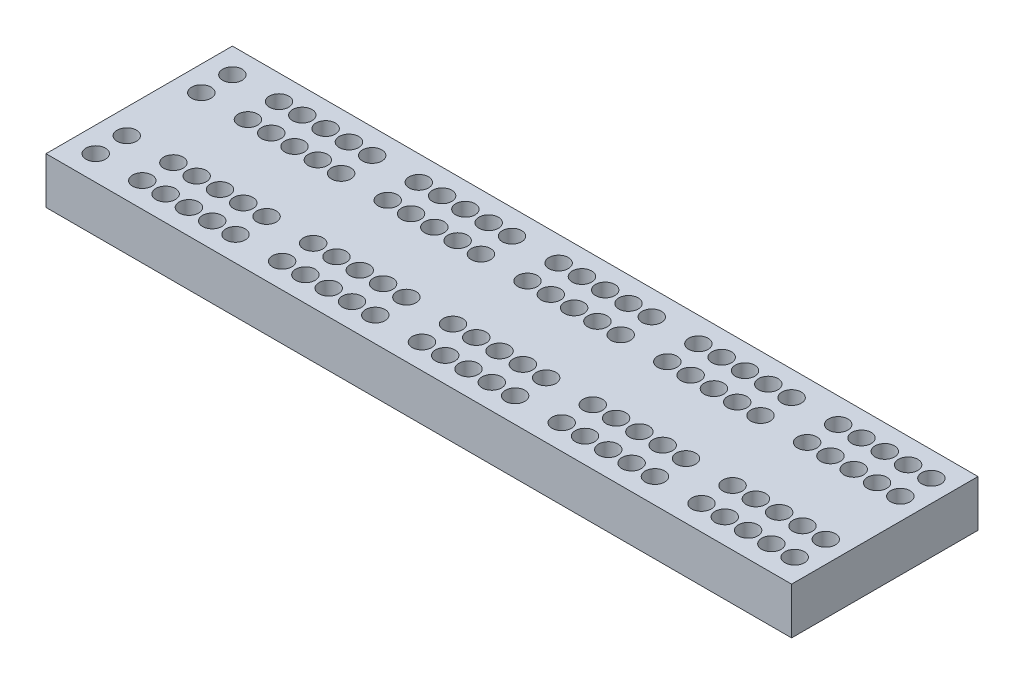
from build123d import *

# Parameters (mm, degrees)
SKETCH1_W            = 304.8
SKETCH1_H            = 19.05
EXTRUDE1_DEPTH       = 38.1
LPATTERN1_COUNT      = 31
LPATTERN1_PITCH      = 9.525
LPATTERN1_COUNT_DIR2 = 2
LPATTERN1_PITCH_DIR2 = 12.7


with BuildPart() as part:
    # Sketch1 → Extrude1 (new, symmetric)
    with BuildSketch(Plane.XY):
        with Locations((152.4, 9.525)):
            Rectangle(SKETCH1_W, SKETCH1_H)
    extrude(amount=EXTRUDE1_DEPTH, both=True)

    # Sketch2 → 5_16 _0.3125_ Diameter Hole1 (revolve, cut)
    with BuildSketch(Plane(origin=(10.16, 19.05, -27.94), x_dir=(0, 0, 1), z_dir=(1, 0, 0))):
        Polygon((0, 0), (0, 15.084665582), (3.96875, 12.7), (3.96875, 0), align=None)
    f_5_16_0_3125_diameter_hole1 = revolve(axis=Axis((10.16, 25.4, -27.94), (0, -1, 0)), mode=Mode.SUBTRACT)

    # LPattern1: 5_16 _0.3125_ Diameter Hole1 31 × 2, 10 skipped
    with Locations(*[(i * LPATTERN1_PITCH, 0, j * LPATTERN1_PITCH_DIR2) for i in range(LPATTERN1_COUNT) for j in range(LPATTERN1_COUNT_DIR2) if (i, j) not in ((0, 0), (1, 0), (1, 1), (7, 0), (7, 1), (13, 0), (13, 1), (19, 0), (19, 1), (25, 0), (25, 1))]):
        add(f_5_16_0_3125_diameter_hole1, mode=Mode.SUBTRACT)

    # Mirror1: 5_16 _0.3125_ Diameter Hole1 across plane
    add(f_5_16_0_3125_diameter_hole1.mirror(Plane.XY), mode=Mode.SUBTRACT)

    # Mirror1 copy 1 sketch → Mirror1 copy 1 (revolve, cut)
    with BuildSketch(Plane(origin=(10.16, 19.05, 15.24), x_dir=(0, 0, -1), z_dir=(1, 0, 0))):
        Polygon((0, 0), (0, -15.084665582), (3.96875, -12.7), (3.96875, 0), align=None)
    revolve(axis=Axis((10.16, 25.4, 15.24), (0, 1, 0)), mode=Mode.SUBTRACT)

    # Mirror1 copy 2 sketch → Mirror1 copy 2 (revolve, cut)
    with BuildSketch(Plane(origin=(29.21, 19.05, 27.94), x_dir=(0, 0, -1), z_dir=(1, 0, 0))):
        Polygon((0, 0), (0, -15.084665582), (3.96875, -12.7), (3.96875, 0), align=None)
    revolve(axis=Axis((29.21, 25.4, 27.94), (0, 1, 0)), mode=Mode.SUBTRACT)

    # Mirror1 copy 3 sketch → Mirror1 copy 3 (revolve, cut)
    with BuildSketch(Plane(origin=(29.21, 19.05, 15.24), x_dir=(0, 0, -1), z_dir=(1, 0, 0))):
        Polygon((0, 0), (0, -15.084665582), (3.96875, -12.7), (3.96875, 0), align=None)
    revolve(axis=Axis((29.21, 25.4, 15.24), (0, 1, 0)), mode=Mode.SUBTRACT)

    # Mirror1 copy 4 sketch → Mirror1 copy 4 (revolve, cut)
    with BuildSketch(Plane(origin=(38.735, 19.05, 27.94), x_dir=(0, 0, -1), z_dir=(1, 0, 0))):
        Polygon((0, 0), (0, -15.084665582), (3.96875, -12.7), (3.96875, 0), align=None)
    revolve(axis=Axis((38.735, 25.4, 27.94), (0, 1, 0)), mode=Mode.SUBTRACT)

    # Mirror1 copy 5 sketch → Mirror1 copy 5 (revolve, cut)
    with BuildSketch(Plane(origin=(38.735, 19.05, 15.24), x_dir=(0, 0, -1), z_dir=(1, 0, 0))):
        Polygon((0, 0), (0, -15.084665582), (3.96875, -12.7), (3.96875, 0), align=None)
    revolve(axis=Axis((38.735, 25.4, 15.24), (0, 1, 0)), mode=Mode.SUBTRACT)

    # Mirror1 copy 6 sketch → Mirror1 copy 6 (revolve, cut)
    with BuildSketch(Plane(origin=(48.26, 19.05, 27.94), x_dir=(0, 0, -1), z_dir=(1, 0, 0))):
        Polygon((0, 0), (0, -15.084665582), (3.96875, -12.7), (3.96875, 0), align=None)
    revolve(axis=Axis((48.26, 25.4, 27.94), (0, 1, 0)), mode=Mode.SUBTRACT)

    # Mirror1 copy 7 sketch → Mirror1 copy 7 (revolve, cut)
    with BuildSketch(Plane(origin=(48.26, 19.05, 15.24), x_dir=(0, 0, -1), z_dir=(1, 0, 0))):
        Polygon((0, 0), (0, -15.084665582), (3.96875, -12.7), (3.96875, 0), align=None)
    revolve(axis=Axis((48.26, 25.4, 15.24), (0, 1, 0)), mode=Mode.SUBTRACT)

    # Mirror1 copy 8 sketch → Mirror1 copy 8 (revolve, cut)
    with BuildSketch(Plane(origin=(57.785, 19.05, 27.94), x_dir=(0, 0, -1), z_dir=(1, 0, 0))):
        Polygon((0, 0), (0, -15.084665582), (3.96875, -12.7), (3.96875, 0), align=None)
    revolve(axis=Axis((57.785, 25.4, 27.94), (0, 1, 0)), mode=Mode.SUBTRACT)

    # Mirror1 copy 9 sketch → Mirror1 copy 9 (revolve, cut)
    with BuildSketch(Plane(origin=(57.785, 19.05, 15.24), x_dir=(0, 0, -1), z_dir=(1, 0, 0))):
        Polygon((0, 0), (0, -15.084665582), (3.96875, -12.7), (3.96875, 0), align=None)
    revolve(axis=Axis((57.785, 25.4, 15.24), (0, 1, 0)), mode=Mode.SUBTRACT)

    # Mirror1 copy 10 sketch → Mirror1 copy 10 (revolve, cut)
    with BuildSketch(Plane(origin=(67.31, 19.05, 27.94), x_dir=(0, 0, -1), z_dir=(1, 0, 0))):
        Polygon((0, 0), (0, -15.084665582), (3.96875, -12.7), (3.96875, 0), align=None)
    revolve(axis=Axis((67.31, 25.4, 27.94), (0, 1, 0)), mode=Mode.SUBTRACT)

    # Mirror1 copy 11 sketch → Mirror1 copy 11 (revolve, cut)
    with BuildSketch(Plane(origin=(67.31, 19.05, 15.24), x_dir=(0, 0, -1), z_dir=(1, 0, 0))):
        Polygon((0, 0), (0, -15.084665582), (3.96875, -12.7), (3.96875, 0), align=None)
    revolve(axis=Axis((67.31, 25.4, 15.24), (0, 1, 0)), mode=Mode.SUBTRACT)

    # Mirror1 copy 12 sketch → Mirror1 copy 12 (revolve, cut)
    with BuildSketch(Plane(origin=(86.36, 19.05, 27.94), x_dir=(0, 0, -1), z_dir=(1, 0, 0))):
        Polygon((0, 0), (0, -15.084665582), (3.96875, -12.7), (3.96875, 0), align=None)
    revolve(axis=Axis((86.36, 25.4, 27.94), (0, 1, 0)), mode=Mode.SUBTRACT)

    # Mirror1 copy 13 sketch → Mirror1 copy 13 (revolve, cut)
    with BuildSketch(Plane(origin=(86.36, 19.05, 15.24), x_dir=(0, 0, -1), z_dir=(1, 0, 0))):
        Polygon((0, 0), (0, -15.084665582), (3.96875, -12.7), (3.96875, 0), align=None)
    revolve(axis=Axis((86.36, 25.4, 15.24), (0, 1, 0)), mode=Mode.SUBTRACT)

    # Mirror1 copy 14 sketch → Mirror1 copy 14 (revolve, cut)
    with BuildSketch(Plane(origin=(95.885, 19.05, 27.94), x_dir=(0, 0, -1), z_dir=(1, 0, 0))):
        Polygon((0, 0), (0, -15.084665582), (3.96875, -12.7), (3.96875, 0), align=None)
    revolve(axis=Axis((95.885, 25.4, 27.94), (0, 1, 0)), mode=Mode.SUBTRACT)

    # Mirror1 copy 15 sketch → Mirror1 copy 15 (revolve, cut)
    with BuildSketch(Plane(origin=(95.885, 19.05, 15.24), x_dir=(0, 0, -1), z_dir=(1, 0, 0))):
        Polygon((0, 0), (0, -15.084665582), (3.96875, -12.7), (3.96875, 0), align=None)
    revolve(axis=Axis((95.885, 25.4, 15.24), (0, 1, 0)), mode=Mode.SUBTRACT)

    # Mirror1 copy 16 sketch → Mirror1 copy 16 (revolve, cut)
    with BuildSketch(Plane(origin=(105.41, 19.05, 27.94), x_dir=(0, 0, -1), z_dir=(1, 0, 0))):
        Polygon((0, 0), (0, -15.084665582), (3.96875, -12.7), (3.96875, 0), align=None)
    revolve(axis=Axis((105.41, 25.4, 27.94), (0, 1, 0)), mode=Mode.SUBTRACT)

    # Mirror1 copy 17 sketch → Mirror1 copy 17 (revolve, cut)
    with BuildSketch(Plane(origin=(105.41, 19.05, 15.24), x_dir=(0, 0, -1), z_dir=(1, 0, 0))):
        Polygon((0, 0), (0, -15.084665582), (3.96875, -12.7), (3.96875, 0), align=None)
    revolve(axis=Axis((105.41, 25.4, 15.24), (0, 1, 0)), mode=Mode.SUBTRACT)

    # Mirror1 copy 18 sketch → Mirror1 copy 18 (revolve, cut)
    with BuildSketch(Plane(origin=(114.935, 19.05, 27.94), x_dir=(0, 0, -1), z_dir=(1, 0, 0))):
        Polygon((0, 0), (0, -15.084665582), (3.96875, -12.7), (3.96875, 0), align=None)
    revolve(axis=Axis((114.935, 25.4, 27.94), (0, 1, 0)), mode=Mode.SUBTRACT)

    # Mirror1 copy 19 sketch → Mirror1 copy 19 (revolve, cut)
    with BuildSketch(Plane(origin=(114.935, 19.05, 15.24), x_dir=(0, 0, -1), z_dir=(1, 0, 0))):
        Polygon((0, 0), (0, -15.084665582), (3.96875, -12.7), (3.96875, 0), align=None)
    revolve(axis=Axis((114.935, 25.4, 15.24), (0, 1, 0)), mode=Mode.SUBTRACT)

    # Mirror1 copy 20 sketch → Mirror1 copy 20 (revolve, cut)
    with BuildSketch(Plane(origin=(124.46, 19.05, 27.94), x_dir=(0, 0, -1), z_dir=(1, 0, 0))):
        Polygon((0, 0), (0, -15.084665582), (3.96875, -12.7), (3.96875, 0), align=None)
    revolve(axis=Axis((124.46, 25.4, 27.94), (0, 1, 0)), mode=Mode.SUBTRACT)

    # Mirror1 copy 21 sketch → Mirror1 copy 21 (revolve, cut)
    with BuildSketch(Plane(origin=(124.46, 19.05, 15.24), x_dir=(0, 0, -1), z_dir=(1, 0, 0))):
        Polygon((0, 0), (0, -15.084665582), (3.96875, -12.7), (3.96875, 0), align=None)
    revolve(axis=Axis((124.46, 25.4, 15.24), (0, 1, 0)), mode=Mode.SUBTRACT)

    # Mirror1 copy 22 sketch → Mirror1 copy 22 (revolve, cut)
    with BuildSketch(Plane(origin=(143.51, 19.05, 27.94), x_dir=(0, 0, -1), z_dir=(1, 0, 0))):
        Polygon((0, 0), (0, -15.084665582), (3.96875, -12.7), (3.96875, 0), align=None)
    revolve(axis=Axis((143.51, 25.4, 27.94), (0, 1, 0)), mode=Mode.SUBTRACT)

    # Mirror1 copy 23 sketch → Mirror1 copy 23 (revolve, cut)
    with BuildSketch(Plane(origin=(143.51, 19.05, 15.24), x_dir=(0, 0, -1), z_dir=(1, 0, 0))):
        Polygon((0, 0), (0, -15.084665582), (3.96875, -12.7), (3.96875, 0), align=None)
    revolve(axis=Axis((143.51, 25.4, 15.24), (0, 1, 0)), mode=Mode.SUBTRACT)

    # Mirror1 copy 24 sketch → Mirror1 copy 24 (revolve, cut)
    with BuildSketch(Plane(origin=(153.035, 19.05, 27.94), x_dir=(0, 0, -1), z_dir=(1, 0, 0))):
        Polygon((0, 0), (0, -15.084665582), (3.96875, -12.7), (3.96875, 0), align=None)
    revolve(axis=Axis((153.035, 25.4, 27.94), (0, 1, 0)), mode=Mode.SUBTRACT)

    # Mirror1 copy 25 sketch → Mirror1 copy 25 (revolve, cut)
    with BuildSketch(Plane(origin=(153.035, 19.05, 15.24), x_dir=(0, 0, -1), z_dir=(1, 0, 0))):
        Polygon((0, 0), (0, -15.084665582), (3.96875, -12.7), (3.96875, 0), align=None)
    revolve(axis=Axis((153.035, 25.4, 15.24), (0, 1, 0)), mode=Mode.SUBTRACT)

    # Mirror1 copy 26 sketch → Mirror1 copy 26 (revolve, cut)
    with BuildSketch(Plane(origin=(162.56, 19.05, 27.94), x_dir=(0, 0, -1), z_dir=(1, 0, 0))):
        Polygon((0, 0), (0, -15.084665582), (3.96875, -12.7), (3.96875, 0), align=None)
    revolve(axis=Axis((162.56, 25.4, 27.94), (0, 1, 0)), mode=Mode.SUBTRACT)

    # Mirror1 copy 27 sketch → Mirror1 copy 27 (revolve, cut)
    with BuildSketch(Plane(origin=(162.56, 19.05, 15.24), x_dir=(0, 0, -1), z_dir=(1, 0, 0))):
        Polygon((0, 0), (0, -15.084665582), (3.96875, -12.7), (3.96875, 0), align=None)
    revolve(axis=Axis((162.56, 25.4, 15.24), (0, 1, 0)), mode=Mode.SUBTRACT)

    # Mirror1 copy 28 sketch → Mirror1 copy 28 (revolve, cut)
    with BuildSketch(Plane(origin=(172.085, 19.05, 27.94), x_dir=(0, 0, -1), z_dir=(1, 0, 0))):
        Polygon((0, 0), (0, -15.084665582), (3.96875, -12.7), (3.96875, 0), align=None)
    revolve(axis=Axis((172.085, 25.4, 27.94), (0, 1, 0)), mode=Mode.SUBTRACT)

    # Mirror1 copy 29 sketch → Mirror1 copy 29 (revolve, cut)
    with BuildSketch(Plane(origin=(172.085, 19.05, 15.24), x_dir=(0, 0, -1), z_dir=(1, 0, 0))):
        Polygon((0, 0), (0, -15.084665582), (3.96875, -12.7), (3.96875, 0), align=None)
    revolve(axis=Axis((172.085, 25.4, 15.24), (0, 1, 0)), mode=Mode.SUBTRACT)

    # Mirror1 copy 30 sketch → Mirror1 copy 30 (revolve, cut)
    with BuildSketch(Plane(origin=(181.61, 19.05, 27.94), x_dir=(0, 0, -1), z_dir=(1, 0, 0))):
        Polygon((0, 0), (0, -15.084665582), (3.96875, -12.7), (3.96875, 0), align=None)
    revolve(axis=Axis((181.61, 25.4, 27.94), (0, 1, 0)), mode=Mode.SUBTRACT)

    # Mirror1 copy 31 sketch → Mirror1 copy 31 (revolve, cut)
    with BuildSketch(Plane(origin=(181.61, 19.05, 15.24), x_dir=(0, 0, -1), z_dir=(1, 0, 0))):
        Polygon((0, 0), (0, -15.084665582), (3.96875, -12.7), (3.96875, 0), align=None)
    revolve(axis=Axis((181.61, 25.4, 15.24), (0, 1, 0)), mode=Mode.SUBTRACT)

    # Mirror1 copy 32 sketch → Mirror1 copy 32 (revolve, cut)
    with BuildSketch(Plane(origin=(200.66, 19.05, 27.94), x_dir=(0, 0, -1), z_dir=(1, 0, 0))):
        Polygon((0, 0), (0, -15.084665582), (3.96875, -12.7), (3.96875, 0), align=None)
    revolve(axis=Axis((200.66, 25.4, 27.94), (0, 1, 0)), mode=Mode.SUBTRACT)

    # Mirror1 copy 33 sketch → Mirror1 copy 33 (revolve, cut)
    with BuildSketch(Plane(origin=(200.66, 19.05, 15.24), x_dir=(0, 0, -1), z_dir=(1, 0, 0))):
        Polygon((0, 0), (0, -15.084665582), (3.96875, -12.7), (3.96875, 0), align=None)
    revolve(axis=Axis((200.66, 25.4, 15.24), (0, 1, 0)), mode=Mode.SUBTRACT)

    # Mirror1 copy 34 sketch → Mirror1 copy 34 (revolve, cut)
    with BuildSketch(Plane(origin=(210.185, 19.05, 27.94), x_dir=(0, 0, -1), z_dir=(1, 0, 0))):
        Polygon((0, 0), (0, -15.084665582), (3.96875, -12.7), (3.96875, 0), align=None)
    revolve(axis=Axis((210.185, 25.4, 27.94), (0, 1, 0)), mode=Mode.SUBTRACT)

    # Mirror1 copy 35 sketch → Mirror1 copy 35 (revolve, cut)
    with BuildSketch(Plane(origin=(210.185, 19.05, 15.24), x_dir=(0, 0, -1), z_dir=(1, 0, 0))):
        Polygon((0, 0), (0, -15.084665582), (3.96875, -12.7), (3.96875, 0), align=None)
    revolve(axis=Axis((210.185, 25.4, 15.24), (0, 1, 0)), mode=Mode.SUBTRACT)

    # Mirror1 copy 36 sketch → Mirror1 copy 36 (revolve, cut)
    with BuildSketch(Plane(origin=(219.71, 19.05, 27.94), x_dir=(0, 0, -1), z_dir=(1, 0, 0))):
        Polygon((0, 0), (0, -15.084665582), (3.96875, -12.7), (3.96875, 0), align=None)
    revolve(axis=Axis((219.71, 25.4, 27.94), (0, 1, 0)), mode=Mode.SUBTRACT)

    # Mirror1 copy 37 sketch → Mirror1 copy 37 (revolve, cut)
    with BuildSketch(Plane(origin=(219.71, 19.05, 15.24), x_dir=(0, 0, -1), z_dir=(1, 0, 0))):
        Polygon((0, 0), (0, -15.084665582), (3.96875, -12.7), (3.96875, 0), align=None)
    revolve(axis=Axis((219.71, 25.4, 15.24), (0, 1, 0)), mode=Mode.SUBTRACT)

    # Mirror1 copy 38 sketch → Mirror1 copy 38 (revolve, cut)
    with BuildSketch(Plane(origin=(229.235, 19.05, 27.94), x_dir=(0, 0, -1), z_dir=(1, 0, 0))):
        Polygon((0, 0), (0, -15.084665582), (3.96875, -12.7), (3.96875, 0), align=None)
    revolve(axis=Axis((229.235, 25.4, 27.94), (0, 1, 0)), mode=Mode.SUBTRACT)

    # Mirror1 copy 39 sketch → Mirror1 copy 39 (revolve, cut)
    with BuildSketch(Plane(origin=(229.235, 19.05, 15.24), x_dir=(0, 0, -1), z_dir=(1, 0, 0))):
        Polygon((0, 0), (0, -15.084665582), (3.96875, -12.7), (3.96875, 0), align=None)
    revolve(axis=Axis((229.235, 25.4, 15.24), (0, 1, 0)), mode=Mode.SUBTRACT)

    # Mirror1 copy 40 sketch → Mirror1 copy 40 (revolve, cut)
    with BuildSketch(Plane(origin=(238.76, 19.05, 27.94), x_dir=(0, 0, -1), z_dir=(1, 0, 0))):
        Polygon((0, 0), (0, -15.084665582), (3.96875, -12.7), (3.96875, 0), align=None)
    revolve(axis=Axis((238.76, 25.4, 27.94), (0, 1, 0)), mode=Mode.SUBTRACT)

    # Mirror1 copy 41 sketch → Mirror1 copy 41 (revolve, cut)
    with BuildSketch(Plane(origin=(238.76, 19.05, 15.24), x_dir=(0, 0, -1), z_dir=(1, 0, 0))):
        Polygon((0, 0), (0, -15.084665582), (3.96875, -12.7), (3.96875, 0), align=None)
    revolve(axis=Axis((238.76, 25.4, 15.24), (0, 1, 0)), mode=Mode.SUBTRACT)

    # Mirror1 copy 42 sketch → Mirror1 copy 42 (revolve, cut)
    with BuildSketch(Plane(origin=(257.81, 19.05, 27.94), x_dir=(0, 0, -1), z_dir=(1, 0, 0))):
        Polygon((0, 0), (0, -15.084665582), (3.96875, -12.7), (3.96875, 0), align=None)
    revolve(axis=Axis((257.81, 25.4, 27.94), (0, 1, 0)), mode=Mode.SUBTRACT)

    # Mirror1 copy 43 sketch → Mirror1 copy 43 (revolve, cut)
    with BuildSketch(Plane(origin=(257.81, 19.05, 15.24), x_dir=(0, 0, -1), z_dir=(1, 0, 0))):
        Polygon((0, 0), (0, -15.084665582), (3.96875, -12.7), (3.96875, 0), align=None)
    revolve(axis=Axis((257.81, 25.4, 15.24), (0, 1, 0)), mode=Mode.SUBTRACT)

    # Mirror1 copy 44 sketch → Mirror1 copy 44 (revolve, cut)
    with BuildSketch(Plane(origin=(267.335, 19.05, 27.94), x_dir=(0, 0, -1), z_dir=(1, 0, 0))):
        Polygon((0, 0), (0, -15.084665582), (3.96875, -12.7), (3.96875, 0), align=None)
    revolve(axis=Axis((267.335, 25.4, 27.94), (0, 1, 0)), mode=Mode.SUBTRACT)

    # Mirror1 copy 45 sketch → Mirror1 copy 45 (revolve, cut)
    with BuildSketch(Plane(origin=(267.335, 19.05, 15.24), x_dir=(0, 0, -1), z_dir=(1, 0, 0))):
        Polygon((0, 0), (0, -15.084665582), (3.96875, -12.7), (3.96875, 0), align=None)
    revolve(axis=Axis((267.335, 25.4, 15.24), (0, 1, 0)), mode=Mode.SUBTRACT)

    # Mirror1 copy 46 sketch → Mirror1 copy 46 (revolve, cut)
    with BuildSketch(Plane(origin=(276.86, 19.05, 27.94), x_dir=(0, 0, -1), z_dir=(1, 0, 0))):
        Polygon((0, 0), (0, -15.084665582), (3.96875, -12.7), (3.96875, 0), align=None)
    revolve(axis=Axis((276.86, 25.4, 27.94), (0, 1, 0)), mode=Mode.SUBTRACT)

    # Mirror1 copy 47 sketch → Mirror1 copy 47 (revolve, cut)
    with BuildSketch(Plane(origin=(276.86, 19.05, 15.24), x_dir=(0, 0, -1), z_dir=(1, 0, 0))):
        Polygon((0, 0), (0, -15.084665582), (3.96875, -12.7), (3.96875, 0), align=None)
    revolve(axis=Axis((276.86, 25.4, 15.24), (0, 1, 0)), mode=Mode.SUBTRACT)

    # Mirror1 copy 48 sketch → Mirror1 copy 48 (revolve, cut)
    with BuildSketch(Plane(origin=(286.385, 19.05, 27.94), x_dir=(0, 0, -1), z_dir=(1, 0, 0))):
        Polygon((0, 0), (0, -15.084665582), (3.96875, -12.7), (3.96875, 0), align=None)
    revolve(axis=Axis((286.385, 25.4, 27.94), (0, 1, 0)), mode=Mode.SUBTRACT)

    # Mirror1 copy 49 sketch → Mirror1 copy 49 (revolve, cut)
    with BuildSketch(Plane(origin=(286.385, 19.05, 15.24), x_dir=(0, 0, -1), z_dir=(1, 0, 0))):
        Polygon((0, 0), (0, -15.084665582), (3.96875, -12.7), (3.96875, 0), align=None)
    revolve(axis=Axis((286.385, 25.4, 15.24), (0, 1, 0)), mode=Mode.SUBTRACT)

    # Mirror1 copy 50 sketch → Mirror1 copy 50 (revolve, cut)
    with BuildSketch(Plane(origin=(295.91, 19.05, 27.94), x_dir=(0, 0, -1), z_dir=(1, 0, 0))):
        Polygon((0, 0), (0, -15.084665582), (3.96875, -12.7), (3.96875, 0), align=None)
    revolve(axis=Axis((295.91, 25.4, 27.94), (0, 1, 0)), mode=Mode.SUBTRACT)

    # Mirror1 copy 51 sketch → Mirror1 copy 51 (revolve, cut)
    with BuildSketch(Plane(origin=(295.91, 19.05, 15.24), x_dir=(0, 0, -1), z_dir=(1, 0, 0))):
        Polygon((0, 0), (0, -15.084665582), (3.96875, -12.7), (3.96875, 0), align=None)
    revolve(axis=Axis((295.91, 25.4, 15.24), (0, 1, 0)), mode=Mode.SUBTRACT)


solid = part.part
